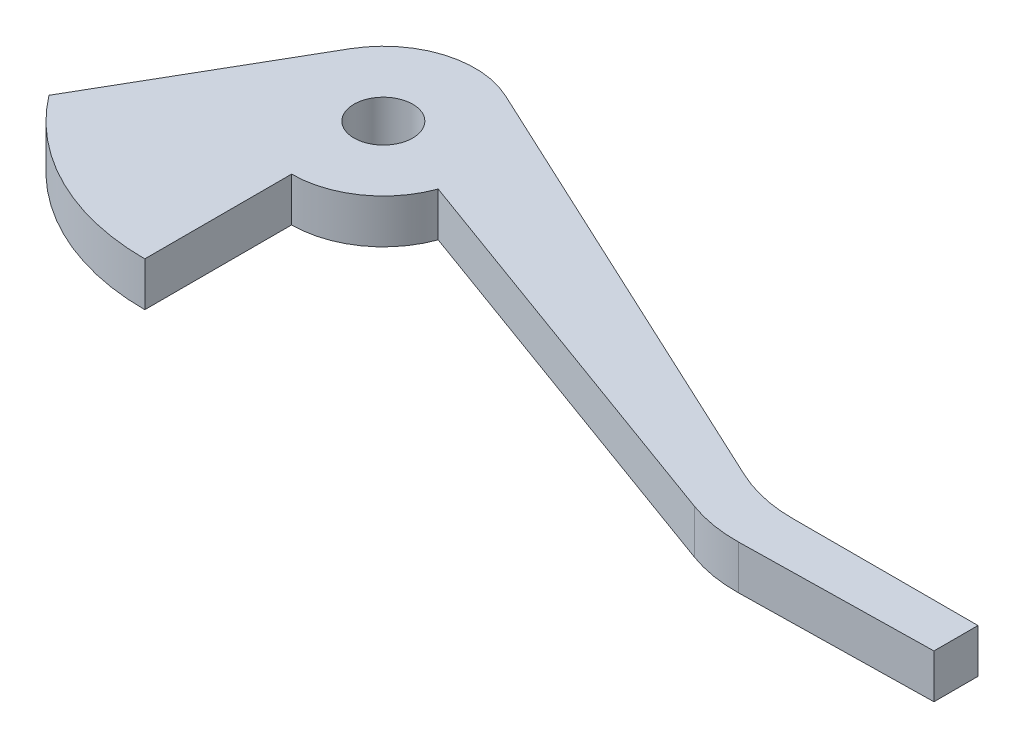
ISO-10303-21;
HEADER;
FILE_DESCRIPTION(('STEP AP214'),'2;1');
FILE_NAME('part.step','',(''),(''),'','','');
FILE_SCHEMA(('AUTOMOTIVE_DESIGN { 1 0 10303 214 1 1 1 1 }'));
ENDSEC;
DATA;
#1=APPLICATION_CONTEXT('core data for automotive mechanical design processes');
#2=APPLICATION_PROTOCOL_DEFINITION('international standard','automotive_design',2000,#1);
#3=PRODUCT_CONTEXT('',#1,'mechanical');
#4=PRODUCT('Part','Part','',(#3));
#5=PRODUCT_RELATED_PRODUCT_CATEGORY('part','',(#4));
#6=PRODUCT_DEFINITION_FORMATION('','',#4);
#7=PRODUCT_DEFINITION_CONTEXT('part definition',#1,'design');
#8=PRODUCT_DEFINITION('design','',#6,#7);
#9=PRODUCT_DEFINITION_SHAPE('','',#8);
#10=(LENGTH_UNIT() NAMED_UNIT(*) SI_UNIT(.MILLI.,.METRE.));
#11=(NAMED_UNIT(*) PLANE_ANGLE_UNIT() SI_UNIT($,.RADIAN.));
#12=(NAMED_UNIT(*) SI_UNIT($,.STERADIAN.) SOLID_ANGLE_UNIT());
#13=UNCERTAINTY_MEASURE_WITH_UNIT(LENGTH_MEASURE(1.E-05),#10,'distance_accuracy_value','');
#14=(GEOMETRIC_REPRESENTATION_CONTEXT(3) GLOBAL_UNCERTAINTY_ASSIGNED_CONTEXT((#13)) GLOBAL_UNIT_ASSIGNED_CONTEXT((#10,
#11,#12)) REPRESENTATION_CONTEXT('',''));
#15=CARTESIAN_POINT('',(0.,0.,0.));
#16=DIRECTION('',(0.,0.,1.));
#17=DIRECTION('',(1.,0.,0.));
#18=AXIS2_PLACEMENT_3D('',#15,#16,#17);
#19=CARTESIAN_POINT('',(3.82178280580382,14.230124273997,57.8624482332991));
#20=DIRECTION('',(0.,1.,0.));
#21=DIRECTION('',(0.,0.,1.));
#22=AXIS2_PLACEMENT_3D('',#19,#20,#21);
#23=PLANE('',#22);
#24=DIRECTION('',(0.939692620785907,0.,0.342020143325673));
#25=VECTOR('',#24,1.);
#26=CARTESIAN_POINT('',(38.8876580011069,14.230124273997,70.6253830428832));
#27=LINE('',#26,#25);
#28=CARTESIAN_POINT('',(9.69486168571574,14.230124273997,60.0000741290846));
#29=VERTEX_POINT('',#28);
#30=CARTESIAN_POINT('',(37.1453058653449,14.230124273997,69.9912187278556));
#31=VERTEX_POINT('',#30);
#32=EDGE_CURVE('E122',#29,#31,#27,.T.);
#33=ORIENTED_EDGE('',*,*,#32,.T.);
#34=CARTESIAN_POINT('',(40.5655072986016,14.230124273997,60.5942925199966));
#35=DIRECTION('',(0.,1.,0.));
#36=DIRECTION('',(0.,0.,1.));
#37=AXIS2_PLACEMENT_3D('',#34,#35,#36);
#38=CIRCLE('',#37,10.);
#39=CARTESIAN_POINT('',(40.7415431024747,14.230124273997,70.592742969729));
#40=VERTEX_POINT('',#39);
#41=EDGE_CURVE('E160',#31,#40,#38,.T.);
#42=ORIENTED_EDGE('',*,*,#41,.T.);
#43=DIRECTION('',(0.999845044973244,0.,-0.0176035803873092));
#44=VECTOR('',#43,1.);
#45=CARTESIAN_POINT('',(53.8217828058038,14.230124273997,70.3624482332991));
#46=LINE('',#45,#44);
#47=CARTESIAN_POINT('',(53.8217828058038,14.230124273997,70.3624482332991));
#48=VERTEX_POINT('',#47);
#49=EDGE_CURVE('E132',#40,#48,#46,.T.);
#50=ORIENTED_EDGE('',*,*,#49,.T.);
#51=DIRECTION('',(0.,0.,-1.));
#52=VECTOR('',#51,1.);
#53=CARTESIAN_POINT('',(53.8217828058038,14.230124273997,67.3624482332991));
#54=LINE('',#53,#52);
#55=CARTESIAN_POINT('',(53.8217828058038,14.230124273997,67.3624482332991));
#56=VERTEX_POINT('',#55);
#57=EDGE_CURVE('E194',#48,#56,#54,.T.);
#58=ORIENTED_EDGE('',*,*,#57,.T.);
#59=DIRECTION('',(-1.,0.,0.));
#60=VECTOR('',#59,1.);
#61=CARTESIAN_POINT('',(38.983358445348,14.230124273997,67.3624482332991));
#62=LINE('',#61,#60);
#63=CARTESIAN_POINT('',(41.2003050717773,14.230124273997,67.3624482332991));
#64=VERTEX_POINT('',#63);
#65=EDGE_CURVE('E190',#56,#64,#62,.T.);
#66=ORIENTED_EDGE('',*,*,#65,.T.);
#67=CARTESIAN_POINT('',(41.2003050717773,14.230124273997,57.3624482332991));
#68=DIRECTION('',(0.,1.,0.));
#69=DIRECTION('',(0.,0.,1.));
#70=AXIS2_PLACEMENT_3D('',#67,#68,#69);
#71=CIRCLE('',#70,10.);
#72=CARTESIAN_POINT('',(36.9741224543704,14.230124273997,66.4255261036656));
#73=VERTEX_POINT('',#72);
#74=EDGE_CURVE('E11',#64,#73,#71,.F.);
#75=ORIENTED_EDGE('',*,*,#74,.T.);
#76=DIRECTION('',(-0.906307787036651,0.,-0.422618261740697));
#77=VECTOR('',#76,1.);
#78=CARTESIAN_POINT('',(6.46314694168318,14.230124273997,52.19802456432));
#79=LINE('',#78,#77);
#80=CARTESIAN_POINT('',(6.46314694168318,14.230124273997,52.19802456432));
#81=VERTEX_POINT('',#80);
#82=EDGE_CURVE('E186',#73,#81,#79,.T.);
#83=ORIENTED_EDGE('',*,*,#82,.T.);
#84=CARTESIAN_POINT('',(3.82178280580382,14.230124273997,57.8624482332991));
#85=DIRECTION('',(0.,1.,0.));
#86=DIRECTION('',(0.,0.,1.));
#87=AXIS2_PLACEMENT_3D('',#84,#85,#86);
#88=CIRCLE('',#87,6.25);
#89=CARTESIAN_POINT('',(-1.59087596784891,14.230124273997,54.7374482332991));
#90=VERTEX_POINT('',#89);
#91=EDGE_CURVE('E189',#81,#90,#88,.T.);
#92=ORIENTED_EDGE('',*,*,#91,.T.);
#93=DIRECTION('',(-0.500000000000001,0.,0.866025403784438));
#94=VECTOR('',#93,1.);
#95=CARTESIAN_POINT('',(-1.59087596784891,14.230124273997,54.7374482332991));
#96=LINE('',#95,#94);
#97=CARTESIAN_POINT('',(-9.09087596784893,14.230124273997,67.7278292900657));
#98=VERTEX_POINT('',#97);
#99=EDGE_CURVE('E192',#90,#98,#96,.T.);
#100=ORIENTED_EDGE('',*,*,#99,.T.);
#101=CARTESIAN_POINT('',(3.82178280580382,14.230124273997,57.8624482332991));
#102=DIRECTION('',(0.,1.,0.));
#103=DIRECTION('',(0.,0.,1.));
#104=AXIS2_PLACEMENT_3D('',#101,#102,#103);
#105=CIRCLE('',#104,16.25);
#106=CARTESIAN_POINT('',(3.82178280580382,14.230124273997,74.1124482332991));
#107=VERTEX_POINT('',#106);
#108=EDGE_CURVE('E199',#98,#107,#105,.T.);
#109=ORIENTED_EDGE('',*,*,#108,.T.);
#110=DIRECTION('',(0.,0.,-1.));
#111=VECTOR('',#110,1.);
#112=CARTESIAN_POINT('',(3.82178280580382,14.230124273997,64.1124482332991));
#113=LINE('',#112,#111);
#114=CARTESIAN_POINT('',(3.82178280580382,14.230124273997,64.1124482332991));
#115=VERTEX_POINT('',#114);
#116=EDGE_CURVE('E138',#107,#115,#113,.T.);
#117=ORIENTED_EDGE('',*,*,#116,.T.);
#118=CARTESIAN_POINT('',(3.82178280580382,14.230124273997,57.8624482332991));
#119=DIRECTION('',(0.,1.,0.));
#120=DIRECTION('',(0.,0.,1.));
#121=AXIS2_PLACEMENT_3D('',#118,#119,#120);
#122=CIRCLE('',#121,6.25);
#123=EDGE_CURVE('E133',#115,#29,#122,.T.);
#124=ORIENTED_EDGE('',*,*,#123,.T.);
#125=EDGE_LOOP('',(#33,#42,#50,#58,#66,#75,#83,#92,#100,#109,#117,#124));
#126=FACE_BOUND('',#125,.T.);
#127=CARTESIAN_POINT('',(3.82178280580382,14.230124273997,57.8624482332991));
#128=DIRECTION('',(0.,1.,0.));
#129=DIRECTION('',(0.,0.,1.));
#130=AXIS2_PLACEMENT_3D('',#127,#128,#129);
#131=CIRCLE('',#130,2.);
#132=CARTESIAN_POINT('',(3.82178280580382,14.230124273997,59.8624482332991));
#133=VERTEX_POINT('',#132);
#134=EDGE_CURVE('E205',#133,#133,#131,.T.);
#135=ORIENTED_EDGE('',*,*,#134,.F.);
#136=EDGE_LOOP('',(#135));
#137=FACE_BOUND('',#136,.T.);
#138=ADVANCED_FACE('F33',(#126,#137),#23,.T.);
#139=CARTESIAN_POINT('',(3.82178280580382,11.230124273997,57.8624482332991));
#140=DIRECTION('',(0.,1.,0.));
#141=DIRECTION('',(0.,0.,1.));
#142=AXIS2_PLACEMENT_3D('',#139,#140,#141);
#143=PLANE('',#142);
#144=DIRECTION('',(0.999845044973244,0.,-0.0176035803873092));
#145=VECTOR('',#144,1.);
#146=CARTESIAN_POINT('',(53.8217828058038,11.230124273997,70.3624482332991));
#147=LINE('',#146,#145);
#148=CARTESIAN_POINT('',(40.7415431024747,11.230124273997,70.592742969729));
#149=VERTEX_POINT('',#148);
#150=CARTESIAN_POINT('',(53.8217828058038,11.230124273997,70.3624482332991));
#151=VERTEX_POINT('',#150);
#152=EDGE_CURVE('E207',#149,#151,#147,.T.);
#153=ORIENTED_EDGE('',*,*,#152,.F.);
#154=CARTESIAN_POINT('',(40.5655072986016,11.230124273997,60.5942925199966));
#155=DIRECTION('',(0.,1.,0.));
#156=DIRECTION('',(0.,0.,1.));
#157=AXIS2_PLACEMENT_3D('',#154,#155,#156);
#158=CIRCLE('',#157,10.);
#159=CARTESIAN_POINT('',(37.1453058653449,11.230124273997,69.9912187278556));
#160=VERTEX_POINT('',#159);
#161=EDGE_CURVE('E151',#149,#160,#158,.F.);
#162=ORIENTED_EDGE('',*,*,#161,.T.);
#163=DIRECTION('',(0.939692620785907,0.,0.342020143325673));
#164=VECTOR('',#163,1.);
#165=CARTESIAN_POINT('',(38.8876580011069,11.230124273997,70.6253830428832));
#166=LINE('',#165,#164);
#167=CARTESIAN_POINT('',(9.69486168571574,11.230124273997,60.0000741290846));
#168=VERTEX_POINT('',#167);
#169=EDGE_CURVE('E204',#168,#160,#166,.T.);
#170=ORIENTED_EDGE('',*,*,#169,.F.);
#171=CARTESIAN_POINT('',(3.82178280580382,11.230124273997,57.8624482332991));
#172=DIRECTION('',(0.,1.,0.));
#173=DIRECTION('',(0.,0.,1.));
#174=AXIS2_PLACEMENT_3D('',#171,#172,#173);
#175=CIRCLE('',#174,6.25);
#176=CARTESIAN_POINT('',(3.82178280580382,11.230124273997,64.1124482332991));
#177=VERTEX_POINT('',#176);
#178=EDGE_CURVE('E146',#177,#168,#175,.T.);
#179=ORIENTED_EDGE('',*,*,#178,.F.);
#180=DIRECTION('',(0.,0.,-1.));
#181=VECTOR('',#180,1.);
#182=CARTESIAN_POINT('',(3.82178280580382,11.230124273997,64.1124482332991));
#183=LINE('',#182,#181);
#184=CARTESIAN_POINT('',(3.82178280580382,11.230124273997,74.1124482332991));
#185=VERTEX_POINT('',#184);
#186=EDGE_CURVE('E142',#185,#177,#183,.T.);
#187=ORIENTED_EDGE('',*,*,#186,.F.);
#188=CARTESIAN_POINT('',(3.82178280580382,11.230124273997,57.8624482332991));
#189=DIRECTION('',(0.,1.,0.));
#190=DIRECTION('',(0.,0.,1.));
#191=AXIS2_PLACEMENT_3D('',#188,#189,#190);
#192=CIRCLE('',#191,16.25);
#193=CARTESIAN_POINT('',(-9.09087596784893,11.230124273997,67.7278292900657));
#194=VERTEX_POINT('',#193);
#195=EDGE_CURVE('E215',#194,#185,#192,.T.);
#196=ORIENTED_EDGE('',*,*,#195,.F.);
#197=DIRECTION('',(-0.500000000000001,0.,0.866025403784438));
#198=VECTOR('',#197,1.);
#199=CARTESIAN_POINT('',(-1.59087596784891,11.230124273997,54.7374482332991));
#200=LINE('',#199,#198);
#201=CARTESIAN_POINT('',(-1.59087596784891,11.230124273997,54.7374482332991));
#202=VERTEX_POINT('',#201);
#203=EDGE_CURVE('E213',#202,#194,#200,.T.);
#204=ORIENTED_EDGE('',*,*,#203,.F.);
#205=CARTESIAN_POINT('',(3.82178280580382,11.230124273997,57.8624482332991));
#206=DIRECTION('',(0.,1.,0.));
#207=DIRECTION('',(0.,0.,1.));
#208=AXIS2_PLACEMENT_3D('',#205,#206,#207);
#209=CIRCLE('',#208,6.25);
#210=CARTESIAN_POINT('',(6.46314694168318,11.230124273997,52.19802456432));
#211=VERTEX_POINT('',#210);
#212=EDGE_CURVE('E211',#211,#202,#209,.T.);
#213=ORIENTED_EDGE('',*,*,#212,.F.);
#214=DIRECTION('',(-0.906307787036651,0.,-0.422618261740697));
#215=VECTOR('',#214,1.);
#216=CARTESIAN_POINT('',(6.46314694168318,11.230124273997,52.19802456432));
#217=LINE('',#216,#215);
#218=CARTESIAN_POINT('',(36.9741224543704,11.230124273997,66.4255261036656));
#219=VERTEX_POINT('',#218);
#220=EDGE_CURVE('E174',#219,#211,#217,.T.);
#221=ORIENTED_EDGE('',*,*,#220,.F.);
#222=CARTESIAN_POINT('',(41.2003050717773,11.230124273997,57.3624482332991));
#223=DIRECTION('',(0.,1.,0.));
#224=DIRECTION('',(0.,0.,1.));
#225=AXIS2_PLACEMENT_3D('',#222,#223,#224);
#226=CIRCLE('',#225,10.);
#227=CARTESIAN_POINT('',(41.2003050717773,11.230124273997,67.3624482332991));
#228=VERTEX_POINT('',#227);
#229=EDGE_CURVE('E41',#219,#228,#226,.T.);
#230=ORIENTED_EDGE('',*,*,#229,.T.);
#231=DIRECTION('',(-1.,0.,0.));
#232=VECTOR('',#231,1.);
#233=CARTESIAN_POINT('',(38.983358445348,11.230124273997,67.3624482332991));
#234=LINE('',#233,#232);
#235=CARTESIAN_POINT('',(53.8217828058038,11.230124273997,67.3624482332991));
#236=VERTEX_POINT('',#235);
#237=EDGE_CURVE('E172',#236,#228,#234,.T.);
#238=ORIENTED_EDGE('',*,*,#237,.F.);
#239=DIRECTION('',(0.,0.,-1.));
#240=VECTOR('',#239,1.);
#241=CARTESIAN_POINT('',(53.8217828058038,11.230124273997,67.3624482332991));
#242=LINE('',#241,#240);
#243=EDGE_CURVE('E180',#151,#236,#242,.T.);
#244=ORIENTED_EDGE('',*,*,#243,.F.);
#245=EDGE_LOOP('',(#153,#162,#170,#179,#187,#196,#204,#213,#221,#230,#238,#244));
#246=FACE_BOUND('',#245,.T.);
#247=CARTESIAN_POINT('',(3.82178280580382,11.230124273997,57.8624482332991));
#248=DIRECTION('',(0.,1.,0.));
#249=DIRECTION('',(0.,0.,1.));
#250=AXIS2_PLACEMENT_3D('',#247,#248,#249);
#251=CIRCLE('',#250,2.);
#252=CARTESIAN_POINT('',(3.82178280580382,11.230124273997,59.8624482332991));
#253=VERTEX_POINT('',#252);
#254=EDGE_CURVE('E254',#253,#253,#251,.T.);
#255=ORIENTED_EDGE('',*,*,#254,.T.);
#256=EDGE_LOOP('',(#255));
#257=FACE_BOUND('',#256,.T.);
#258=ADVANCED_FACE('F169',(#246,#257),#143,.F.);
#259=CARTESIAN_POINT('',(3.82178280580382,14.230124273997,57.8624482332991));
#260=DIRECTION('',(0.,-1.,0.));
#261=DIRECTION('',(0.,0.,-1.));
#262=AXIS2_PLACEMENT_3D('',#259,#260,#261);
#263=CYLINDRICAL_SURFACE('',#262,6.25);
#264=ORIENTED_EDGE('',*,*,#178,.T.);
#265=DIRECTION('',(0.,-1.,0.));
#266=VECTOR('',#265,1.);
#267=CARTESIAN_POINT('',(9.69486168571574,14.230124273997,60.0000741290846));
#268=LINE('',#267,#266);
#269=EDGE_CURVE('E127',#29,#168,#268,.T.);
#270=ORIENTED_EDGE('',*,*,#269,.F.);
#271=ORIENTED_EDGE('',*,*,#123,.F.);
#272=DIRECTION('',(0.,-1.,0.));
#273=VECTOR('',#272,1.);
#274=CARTESIAN_POINT('',(3.82178280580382,14.230124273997,64.1124482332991));
#275=LINE('',#274,#273);
#276=EDGE_CURVE('E202',#115,#177,#275,.T.);
#277=ORIENTED_EDGE('',*,*,#276,.T.);
#278=EDGE_LOOP('',(#264,#270,#271,#277));
#279=FACE_BOUND('',#278,.T.);
#280=ADVANCED_FACE('F144',(#279),#263,.T.);
#281=CARTESIAN_POINT('',(38.8876580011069,14.230124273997,70.6253830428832));
#282=DIRECTION('',(0.342020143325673,0.,-0.939692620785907));
#283=DIRECTION('',(-0.939692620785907,0.,-0.342020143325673));
#284=AXIS2_PLACEMENT_3D('',#281,#282,#283);
#285=PLANE('',#284);
#286=ORIENTED_EDGE('',*,*,#169,.T.);
#287=DIRECTION('',(0.,-1.,0.));
#288=VECTOR('',#287,1.);
#289=CARTESIAN_POINT('',(37.1453058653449,14.230124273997,69.9912187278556));
#290=LINE('',#289,#288);
#291=EDGE_CURVE('E130',#160,#31,#290,.F.);
#292=ORIENTED_EDGE('',*,*,#291,.T.);
#293=ORIENTED_EDGE('',*,*,#32,.F.);
#294=ORIENTED_EDGE('',*,*,#269,.T.);
#295=EDGE_LOOP('',(#286,#292,#293,#294));
#296=FACE_BOUND('',#295,.T.);
#297=ADVANCED_FACE('F125',(#296),#285,.F.);
#298=CARTESIAN_POINT('',(53.8217828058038,14.230124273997,70.3624482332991));
#299=DIRECTION('',(-0.0176035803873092,0.,-0.999845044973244));
#300=DIRECTION('',(-0.999845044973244,0.,0.0176035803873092));
#301=AXIS2_PLACEMENT_3D('',#298,#299,#300);
#302=PLANE('',#301);
#303=ORIENTED_EDGE('',*,*,#49,.F.);
#304=DIRECTION('',(0.,-1.,0.));
#305=VECTOR('',#304,1.);
#306=CARTESIAN_POINT('',(40.7415431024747,14.230124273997,70.592742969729));
#307=LINE('',#306,#305);
#308=EDGE_CURVE('E147',#40,#149,#307,.T.);
#309=ORIENTED_EDGE('',*,*,#308,.T.);
#310=ORIENTED_EDGE('',*,*,#152,.T.);
#311=DIRECTION('',(0.,-1.,0.));
#312=VECTOR('',#311,1.);
#313=CARTESIAN_POINT('',(53.8217828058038,14.230124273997,70.3624482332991));
#314=LINE('',#313,#312);
#315=EDGE_CURVE('E148',#48,#151,#314,.T.);
#316=ORIENTED_EDGE('',*,*,#315,.F.);
#317=EDGE_LOOP('',(#303,#309,#310,#316));
#318=FACE_BOUND('',#317,.T.);
#319=ADVANCED_FACE('F250',(#318),#302,.F.);
#320=CARTESIAN_POINT('',(53.8217828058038,14.230124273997,67.3624482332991));
#321=DIRECTION('',(-1.,0.,0.));
#322=DIRECTION('',(0.,0.,1.));
#323=AXIS2_PLACEMENT_3D('',#320,#321,#322);
#324=PLANE('',#323);
#325=ORIENTED_EDGE('',*,*,#243,.T.);
#326=DIRECTION('',(0.,-1.,0.));
#327=VECTOR('',#326,1.);
#328=CARTESIAN_POINT('',(53.8217828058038,14.230124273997,67.3624482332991));
#329=LINE('',#328,#327);
#330=EDGE_CURVE('E154',#56,#236,#329,.T.);
#331=ORIENTED_EDGE('',*,*,#330,.F.);
#332=ORIENTED_EDGE('',*,*,#57,.F.);
#333=ORIENTED_EDGE('',*,*,#315,.T.);
#334=EDGE_LOOP('',(#325,#331,#332,#333));
#335=FACE_BOUND('',#334,.T.);
#336=ADVANCED_FACE('F282',(#335),#324,.F.);
#337=CARTESIAN_POINT('',(38.983358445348,14.230124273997,67.3624482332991));
#338=DIRECTION('',(0.,0.,1.));
#339=DIRECTION('',(1.,0.,0.));
#340=AXIS2_PLACEMENT_3D('',#337,#338,#339);
#341=PLANE('',#340);
#342=ORIENTED_EDGE('',*,*,#237,.T.);
#343=DIRECTION('',(0.,-1.,0.));
#344=VECTOR('',#343,1.);
#345=CARTESIAN_POINT('',(41.2003050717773,14.230124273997,67.3624482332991));
#346=LINE('',#345,#344);
#347=EDGE_CURVE('E54',#228,#64,#346,.F.);
#348=ORIENTED_EDGE('',*,*,#347,.T.);
#349=ORIENTED_EDGE('',*,*,#65,.F.);
#350=ORIENTED_EDGE('',*,*,#330,.T.);
#351=EDGE_LOOP('',(#342,#348,#349,#350));
#352=FACE_BOUND('',#351,.T.);
#353=ADVANCED_FACE('F178',(#352),#341,.F.);
#354=CARTESIAN_POINT('',(6.46314694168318,14.230124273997,52.19802456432));
#355=DIRECTION('',(-0.422618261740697,0.,0.906307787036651));
#356=DIRECTION('',(0.906307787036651,0.,0.422618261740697));
#357=AXIS2_PLACEMENT_3D('',#354,#355,#356);
#358=PLANE('',#357);
#359=ORIENTED_EDGE('',*,*,#82,.F.);
#360=DIRECTION('',(0.,-1.,0.));
#361=VECTOR('',#360,1.);
#362=CARTESIAN_POINT('',(36.9741224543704,11.230124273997,66.4255261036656));
#363=LINE('',#362,#361);
#364=EDGE_CURVE('E162',#73,#219,#363,.T.);
#365=ORIENTED_EDGE('',*,*,#364,.T.);
#366=ORIENTED_EDGE('',*,*,#220,.T.);
#367=DIRECTION('',(0.,-1.,0.));
#368=VECTOR('',#367,1.);
#369=CARTESIAN_POINT('',(6.46314694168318,14.230124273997,52.19802456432));
#370=LINE('',#369,#368);
#371=EDGE_CURVE('E187',#81,#211,#370,.T.);
#372=ORIENTED_EDGE('',*,*,#371,.F.);
#373=EDGE_LOOP('',(#359,#365,#366,#372));
#374=FACE_BOUND('',#373,.T.);
#375=ADVANCED_FACE('F183',(#374),#358,.F.);
#376=CARTESIAN_POINT('',(3.82178280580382,14.230124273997,57.8624482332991));
#377=DIRECTION('',(0.,-1.,0.));
#378=DIRECTION('',(0.,0.,-1.));
#379=AXIS2_PLACEMENT_3D('',#376,#377,#378);
#380=CYLINDRICAL_SURFACE('',#379,6.25);
#381=ORIENTED_EDGE('',*,*,#212,.T.);
#382=DIRECTION('',(0.,-1.,0.));
#383=VECTOR('',#382,1.);
#384=CARTESIAN_POINT('',(-1.59087596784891,14.230124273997,54.7374482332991));
#385=LINE('',#384,#383);
#386=EDGE_CURVE('E225',#90,#202,#385,.T.);
#387=ORIENTED_EDGE('',*,*,#386,.F.);
#388=ORIENTED_EDGE('',*,*,#91,.F.);
#389=ORIENTED_EDGE('',*,*,#371,.T.);
#390=EDGE_LOOP('',(#381,#387,#388,#389));
#391=FACE_BOUND('',#390,.T.);
#392=ADVANCED_FACE('F229',(#391),#380,.T.);
#393=CARTESIAN_POINT('',(-1.59087596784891,14.230124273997,54.7374482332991));
#394=DIRECTION('',(0.866025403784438,0.,0.500000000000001));
#395=DIRECTION('',(0.500000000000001,0.,-0.866025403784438));
#396=AXIS2_PLACEMENT_3D('',#393,#394,#395);
#397=PLANE('',#396);
#398=ORIENTED_EDGE('',*,*,#203,.T.);
#399=DIRECTION('',(0.,-1.,0.));
#400=VECTOR('',#399,1.);
#401=CARTESIAN_POINT('',(-9.09087596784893,14.230124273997,67.7278292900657));
#402=LINE('',#401,#400);
#403=EDGE_CURVE('E222',#98,#194,#402,.T.);
#404=ORIENTED_EDGE('',*,*,#403,.F.);
#405=ORIENTED_EDGE('',*,*,#99,.F.);
#406=ORIENTED_EDGE('',*,*,#386,.T.);
#407=EDGE_LOOP('',(#398,#404,#405,#406));
#408=FACE_BOUND('',#407,.T.);
#409=ADVANCED_FACE('F236',(#408),#397,.F.);
#410=CARTESIAN_POINT('',(3.82178280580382,14.230124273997,57.8624482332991));
#411=DIRECTION('',(0.,-1.,0.));
#412=DIRECTION('',(0.,0.,-1.));
#413=AXIS2_PLACEMENT_3D('',#410,#411,#412);
#414=CYLINDRICAL_SURFACE('',#413,16.25);
#415=ORIENTED_EDGE('',*,*,#195,.T.);
#416=DIRECTION('',(0.,-1.,0.));
#417=VECTOR('',#416,1.);
#418=CARTESIAN_POINT('',(3.82178280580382,14.230124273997,74.1124482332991));
#419=LINE('',#418,#417);
#420=EDGE_CURVE('E219',#107,#185,#419,.T.);
#421=ORIENTED_EDGE('',*,*,#420,.F.);
#422=ORIENTED_EDGE('',*,*,#108,.F.);
#423=ORIENTED_EDGE('',*,*,#403,.T.);
#424=EDGE_LOOP('',(#415,#421,#422,#423));
#425=FACE_BOUND('',#424,.T.);
#426=ADVANCED_FACE('F240',(#425),#414,.T.);
#427=CARTESIAN_POINT('',(3.82178280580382,14.230124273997,64.1124482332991));
#428=DIRECTION('',(-1.,0.,0.));
#429=DIRECTION('',(0.,0.,1.));
#430=AXIS2_PLACEMENT_3D('',#427,#428,#429);
#431=PLANE('',#430);
#432=ORIENTED_EDGE('',*,*,#186,.T.);
#433=ORIENTED_EDGE('',*,*,#276,.F.);
#434=ORIENTED_EDGE('',*,*,#116,.F.);
#435=ORIENTED_EDGE('',*,*,#420,.T.);
#436=EDGE_LOOP('',(#432,#433,#434,#435));
#437=FACE_BOUND('',#436,.T.);
#438=ADVANCED_FACE('F243',(#437),#431,.F.);
#439=CARTESIAN_POINT('',(3.82178280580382,14.230124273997,57.8624482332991));
#440=DIRECTION('',(0.,-1.,0.));
#441=DIRECTION('',(0.,0.,-1.));
#442=AXIS2_PLACEMENT_3D('',#439,#440,#441);
#443=CYLINDRICAL_SURFACE('',#442,2.);
#444=ORIENTED_EDGE('',*,*,#134,.T.);
#445=EDGE_LOOP('',(#444));
#446=FACE_BOUND('',#445,.T.);
#447=ORIENTED_EDGE('',*,*,#254,.F.);
#448=EDGE_LOOP('',(#447));
#449=FACE_BOUND('',#448,.T.);
#450=ADVANCED_FACE('F260',(#446,#449),#443,.F.);
#451=CARTESIAN_POINT('',(40.5655072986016,14.230124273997,60.5942925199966));
#452=DIRECTION('',(0.,-1.,0.));
#453=DIRECTION('',(0.,0.,-1.));
#454=AXIS2_PLACEMENT_3D('',#451,#452,#453);
#455=CYLINDRICAL_SURFACE('',#454,10.);
#456=ORIENTED_EDGE('',*,*,#41,.F.);
#457=ORIENTED_EDGE('',*,*,#291,.F.);
#458=ORIENTED_EDGE('',*,*,#161,.F.);
#459=ORIENTED_EDGE('',*,*,#308,.F.);
#460=EDGE_LOOP('',(#456,#457,#458,#459));
#461=FACE_BOUND('',#460,.T.);
#462=ADVANCED_FACE('F245',(#461),#455,.T.);
#463=CARTESIAN_POINT('',(41.2003050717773,14.230124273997,57.3624482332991));
#464=DIRECTION('',(0.,1.,0.));
#465=DIRECTION('',(0.,0.,1.));
#466=AXIS2_PLACEMENT_3D('',#463,#464,#465);
#467=CYLINDRICAL_SURFACE('',#466,10.);
#468=ORIENTED_EDGE('',*,*,#74,.F.);
#469=ORIENTED_EDGE('',*,*,#347,.F.);
#470=ORIENTED_EDGE('',*,*,#229,.F.);
#471=ORIENTED_EDGE('',*,*,#364,.F.);
#472=EDGE_LOOP('',(#468,#469,#470,#471));
#473=FACE_BOUND('',#472,.T.);
#474=ADVANCED_FACE('F35',(#473),#467,.F.);
#475=CLOSED_SHELL('',(#138,#258,#280,#297,#319,#336,#353,#375,#392,#409,#426,#438,#450,#462,#474));
#476=MANIFOLD_SOLID_BREP('B2',#475);
#477=ADVANCED_BREP_SHAPE_REPRESENTATION('',(#18,#476),#14);
#478=SHAPE_DEFINITION_REPRESENTATION(#9,#477);
ENDSEC;
END-ISO-10303-21;
